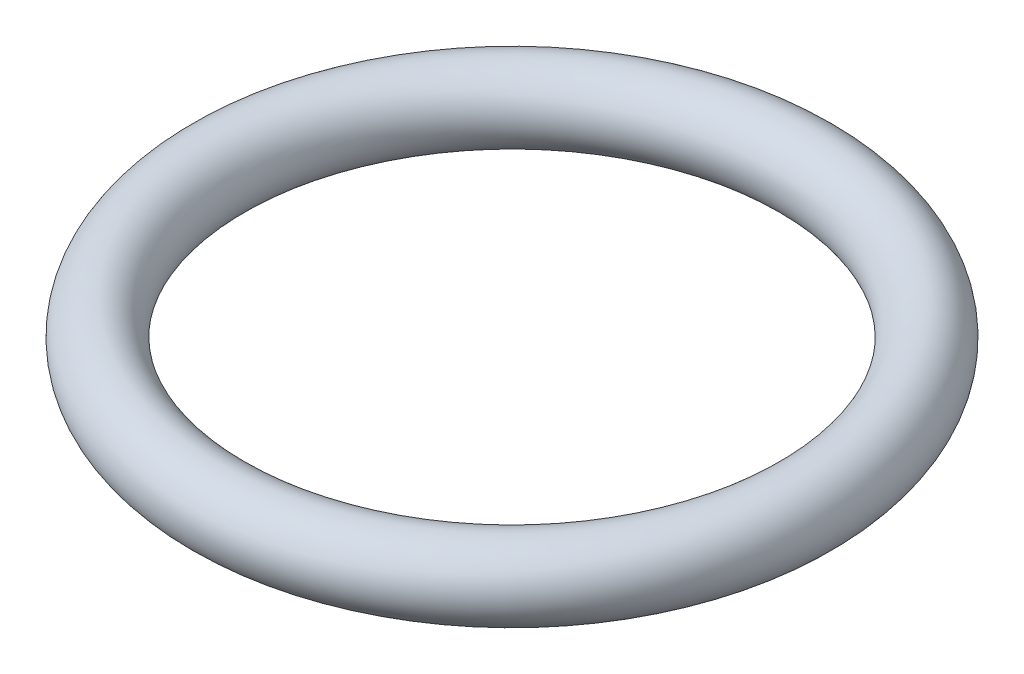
from build123d import *

# Parameters (mm, degrees)
ESQUISSE1_R = 2.62


with BuildPart() as part:
    # Esquisse1 → R_volution1 (revolve)
    with BuildSketch(Plane(origin=(0, 0, 0), x_dir=(0, 0, -1), z_dir=(1, 0, 0)), mode=Mode.PRIVATE) as r_volution1_sk:
        with Locations((-21.12, 0)):
            Circle(ESQUISSE1_R)
    revolve(r_volution1_sk.sketch.rotate(Axis((0, -35.010810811, 0), (0, 1, 0)), 180), axis=Axis((0, -35.010810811, 0), (0, 1, 0)))


solid = part.part
